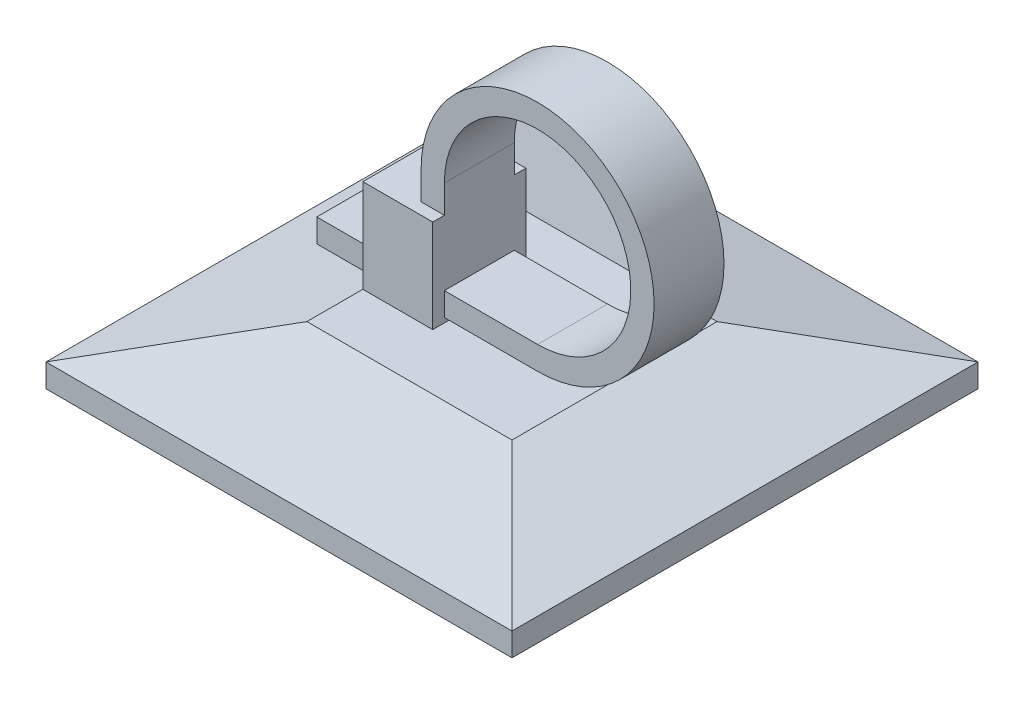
from build123d import *

# Parameters (mm, degrees)
SKETCH1_W           = 20
SKETCH1_H           = 20
EXTRUDE1_DEPTH      = 1
SKETCH2_W           = 20
SKETCH2_H           = 20
EXTRUDE2_DEPTH      = 1.5
EXTRUDE2_TAPER      = 75
SKETCH3_W           = 3
SKETCH3_H           = 4
EXTRUDE3_DEPTH      = 2
EXTRUDE_THIN1_DEPTH = 1.5


with BuildPart() as part:
    # Sketch1 → Extrude1 (new body)
    with BuildSketch(Plane(origin=(0, 0, 0), x_dir=(1, 0, 0), z_dir=(0, 1, 0))):
        Rectangle(SKETCH1_W, SKETCH1_H)
    extrude(amount=EXTRUDE1_DEPTH)

    # Sketch2 → Extrude2 (add)
    with BuildSketch(Plane(origin=(0, 1, 0), x_dir=(-1, 0, 0), z_dir=(0, 1, 0))):
        Rectangle(SKETCH2_W, SKETCH2_H)
    extrude(amount=EXTRUDE2_DEPTH, taper=EXTRUDE2_TAPER)

    # Sketch3 → Extrude3 (add, symmetric)
    with BuildSketch(Plane.XY):
        with Locations((-2.901923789, 4.5)):
            Rectangle(SKETCH3_W, SKETCH3_H)
    extrude(amount=EXTRUDE3_DEPTH, both=True)

    # Sketch4 → Extrude-Thin1 (add, symmetric)
    with BuildSketch(Plane.XY):
        with BuildLine():
            Line((-1.401923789, 6.5), (-1.401923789, 7.7))
            ThreePointArc((-1.401923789, 7.7), (5.426503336, 10.528427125), (2.598076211, 3.7))
            Line((2.598076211, 3.7), (-6.87859684, 3.7))
            Line((-6.87859684, 3.7), (-6.87859684, 2.7))
            Line((-6.87859684, 2.7), (2.598076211, 2.7))
            ThreePointArc((2.598076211, 2.7), (6.133610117, 11.235533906), (-2.401923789, 7.7))
            Line((-2.401923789, 7.7), (-2.401923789, 6.5))
            Line((-2.401923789, 6.5), (-1.401923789, 6.5))
        make_face()
    extrude(amount=EXTRUDE_THIN1_DEPTH, both=True)


solid = part.part
